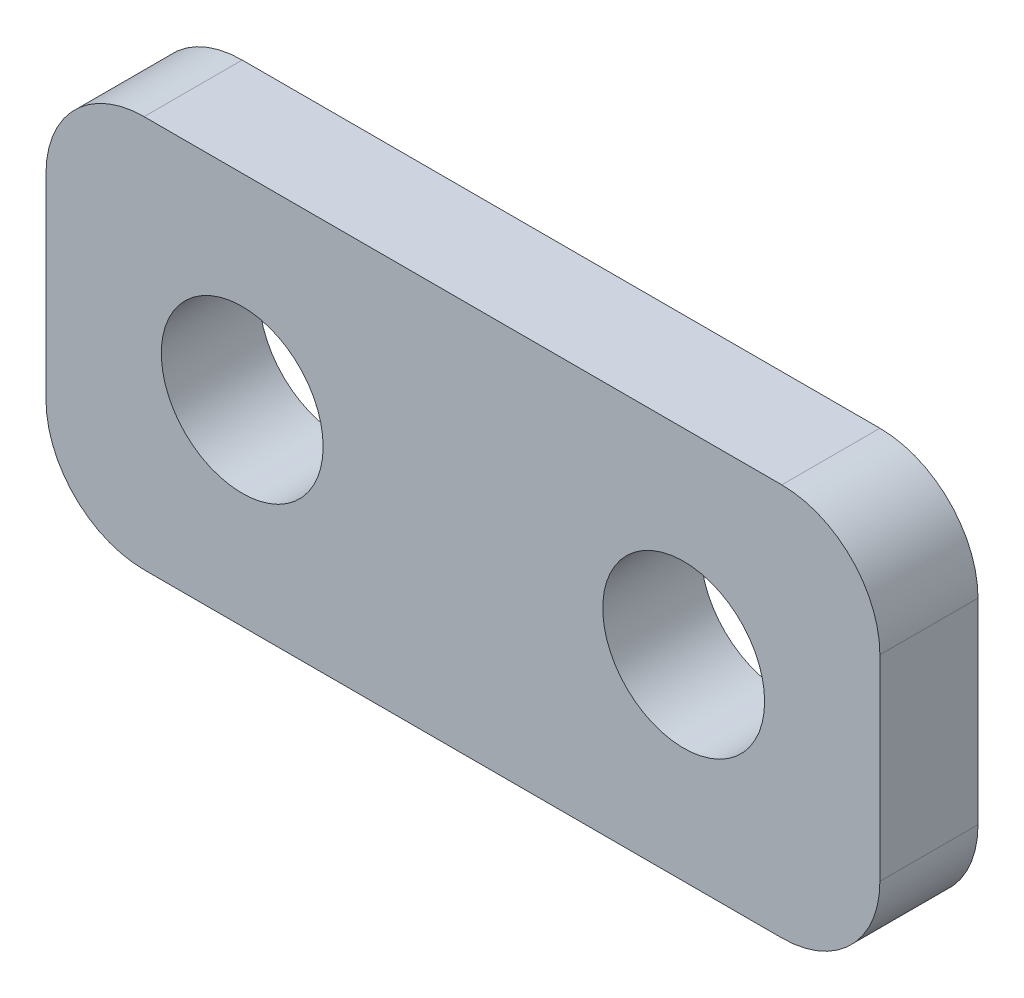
from build123d import *

# Parameters (mm, degrees)
SKETCH_1_W         = 17
SKETCH_1_H         = 8
EXTRUDE_1_DEPTH    = 2
HOLE_WIZARD_M4_1_D = 3.3
FILLET_1_R         = 2


with BuildPart() as part:
    # Sketch 1 → Extrude 1 (new body)
    with BuildSketch(Plane.XY):
        Rectangle(SKETCH_1_W, SKETCH_1_H)
    extrude(amount=EXTRUDE_1_DEPTH)

    # Hole Wizard M4 _1 (through all)
    with Locations(Plane.XY.offset(2)):
        with Locations((-4.5, 0), (4.5, 0)):
            Hole(HOLE_WIZARD_M4_1_D / 2)

    # Fillet 1
    fillet_1_edges = [part.edges().sort_by_distance(p)[0] for p in [
        (8.5, -4, 1),
        (-8.5, -4, 1),
        (-8.5, 4, 1),
        (8.5, 4, 1),
    ]]
    fillet(fillet_1_edges, radius=FILLET_1_R)


solid = part.part
